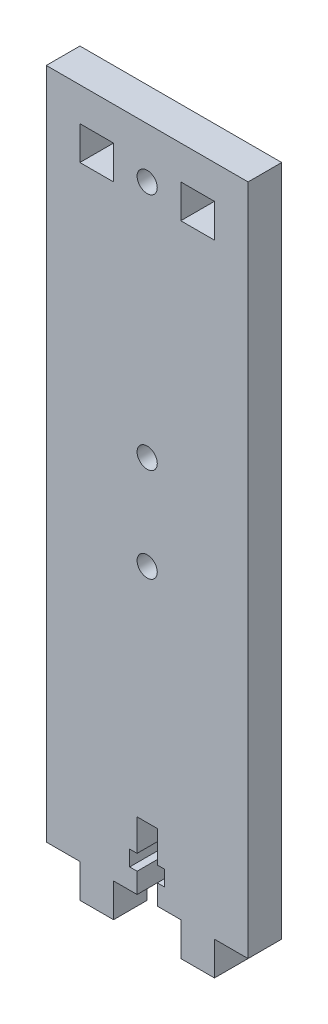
from build123d import *

# Parameters (mm, degrees)
ESQUISSE1_R        = 1.5
ESQUISSE1_W        = 5
ESQUISSE1_H        = 5
BOSS_EXTRU_1_DEPTH = 5


with BuildPart() as part:
    # Esquisse1 → Boss.-Extru.1 (new body)
    with BuildSketch(Plane.XY):
        Polygon((-10, 0), (-15, 0), (-15, 90), (-15, 100), (15, 100), (15, 90), (15, 0), (10, 0), (10, -5), (5, -5), (5, 0), (1.5, 0), (1.5, 3), (2.6, 3), (2.6, 5.3), (1.5, 5.3), (1.5, 10), (-1.5, 10), (-1.5, 5.3), (-2.6, 5.3), (-2.6, 3), (-1.5, 3), (-1.5, 0), (-5, 0), (-5, -5), (-10, -5), align=None)
        with Locations((0, 57)):
            Circle(ESQUISSE1_R, mode=Mode.SUBTRACT)
        with Locations((0, 43)):
            Circle(ESQUISSE1_R, mode=Mode.SUBTRACT)
        with Locations((0, 92.5)):
            Circle(ESQUISSE1_R, mode=Mode.SUBTRACT)
        with Locations((-7.5, 92.5)):
            Rectangle(ESQUISSE1_W, ESQUISSE1_H, mode=Mode.SUBTRACT)
        with Locations((7.5, 92.5)):
            Rectangle(ESQUISSE1_W, ESQUISSE1_H, mode=Mode.SUBTRACT)
    extrude(amount=BOSS_EXTRU_1_DEPTH)


solid = part.part
